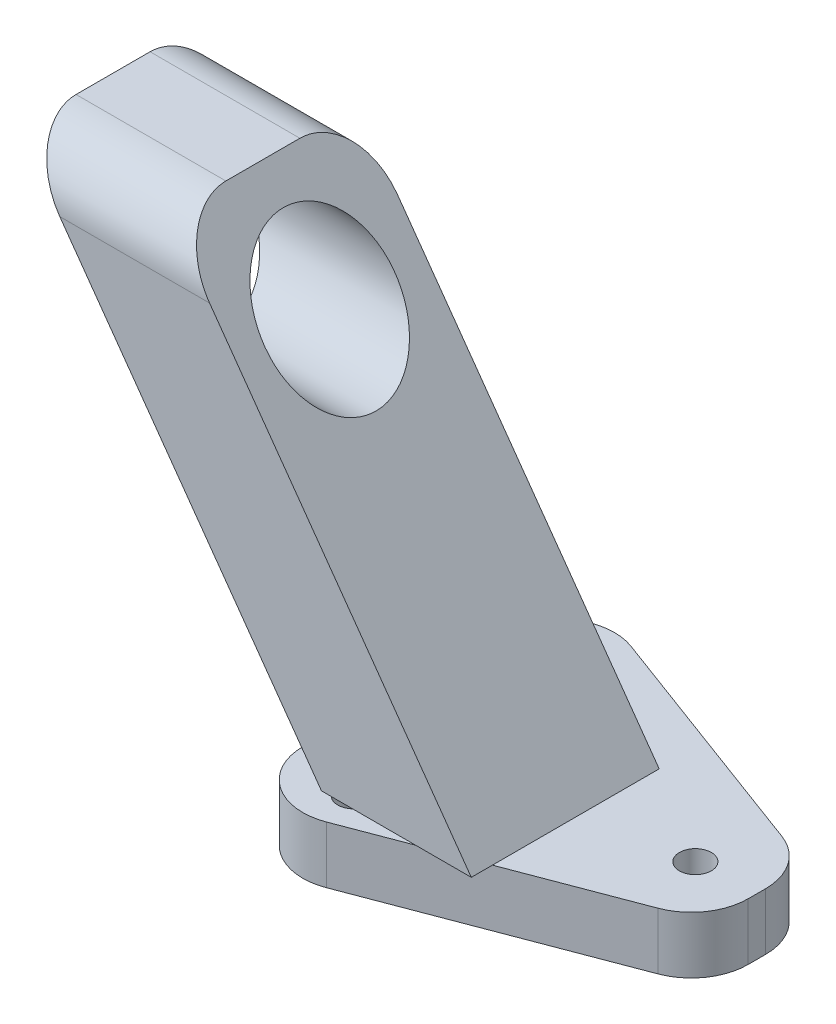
ISO-10303-21;
HEADER;
FILE_DESCRIPTION(('STEP AP214'),'2;1');
FILE_NAME('part.step','',(''),(''),'','','');
FILE_SCHEMA(('AUTOMOTIVE_DESIGN { 1 0 10303 214 1 1 1 1 }'));
ENDSEC;
DATA;
#1=APPLICATION_CONTEXT('core data for automotive mechanical design processes');
#2=APPLICATION_PROTOCOL_DEFINITION('international standard','automotive_design',2000,#1);
#3=PRODUCT_CONTEXT('',#1,'mechanical');
#4=PRODUCT('Part','Part','',(#3));
#5=PRODUCT_RELATED_PRODUCT_CATEGORY('part','',(#4));
#6=PRODUCT_DEFINITION_FORMATION('','',#4);
#7=PRODUCT_DEFINITION_CONTEXT('part definition',#1,'design');
#8=PRODUCT_DEFINITION('design','',#6,#7);
#9=PRODUCT_DEFINITION_SHAPE('','',#8);
#10=(LENGTH_UNIT() NAMED_UNIT(*) SI_UNIT(.MILLI.,.METRE.));
#11=(NAMED_UNIT(*) PLANE_ANGLE_UNIT() SI_UNIT($,.RADIAN.));
#12=(NAMED_UNIT(*) SI_UNIT($,.STERADIAN.) SOLID_ANGLE_UNIT());
#13=UNCERTAINTY_MEASURE_WITH_UNIT(LENGTH_MEASURE(1.E-05),#10,'distance_accuracy_value','');
#14=(GEOMETRIC_REPRESENTATION_CONTEXT(3) GLOBAL_UNCERTAINTY_ASSIGNED_CONTEXT((#13)) GLOBAL_UNIT_ASSIGNED_CONTEXT((#10,
#11,#12)) REPRESENTATION_CONTEXT('',''));
#15=CARTESIAN_POINT('',(0.,0.,0.));
#16=DIRECTION('',(0.,0.,1.));
#17=DIRECTION('',(1.,0.,0.));
#18=AXIS2_PLACEMENT_3D('',#15,#16,#17);
#19=CARTESIAN_POINT('',(-36.1014587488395,42.2803798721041,-16.5));
#20=DIRECTION('',(-0.813802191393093,-0.58114197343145,0.));
#21=DIRECTION('',(0.58114197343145,-0.813802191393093,0.));
#22=AXIS2_PLACEMENT_3D('',#19,#20,#21);
#23=PLANE('',#22);
#24=CARTESIAN_POINT('',(-30.0659973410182,33.828621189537,-8.15405274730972));
#25=DIRECTION('',(-0.813802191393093,-0.58114197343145,0.));
#26=DIRECTION('',(0.58114197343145,-0.813802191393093,0.));
#27=AXIS2_PLACEMENT_3D('',#24,#25,#26);
#28=ELLIPSE('',#27,7.00415906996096,5.7);
#29=CARTESIAN_POINT('',(-25.9955865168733,28.128621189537,-8.15405274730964));
#30=VERTEX_POINT('',#29);
#31=EDGE_CURVE('E176',#30,#30,#28,.T.);
#32=ORIENTED_EDGE('',*,*,#31,.F.);
#33=EDGE_LOOP('',(#32));
#34=FACE_BOUND('',#33,.T.);
#35=DIRECTION('',(0.58114197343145,-0.813802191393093,0.));
#36=VECTOR('',#35,1.);
#37=CARTESIAN_POINT('',(-36.1014587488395,42.2803798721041,0.));
#38=LINE('',#37,#36);
#39=CARTESIAN_POINT('',(-32.4595122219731,37.1803798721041,0.));
#40=VERTEX_POINT('',#39);
#41=CARTESIAN_POINT('',(-9.47927247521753,5.,0.));
#42=VERTEX_POINT('',#41);
#43=EDGE_CURVE('E171',#40,#42,#38,.T.);
#44=ORIENTED_EDGE('',*,*,#43,.F.);
#45=CARTESIAN_POINT('',(-32.4595122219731,37.1803798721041,-5.));
#46=DIRECTION('',(-0.813802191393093,-0.58114197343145,0.));
#47=DIRECTION('',(-0.58114197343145,0.813802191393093,0.));
#48=AXIS2_PLACEMENT_3D('',#45,#46,#47);
#49=ELLIPSE('',#48,6.14399918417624,5.);
#50=CARTESIAN_POINT('',(-36.0300480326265,42.1803798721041,-5.));
#51=VERTEX_POINT('',#50);
#52=EDGE_CURVE('E278',#40,#51,#49,.T.);
#53=ORIENTED_EDGE('',*,*,#52,.T.);
#54=DIRECTION('',(0.,0.,-1.));
#55=VECTOR('',#54,1.);
#56=CARTESIAN_POINT('',(-36.0300480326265,42.1803798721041,-16.5));
#57=LINE('',#56,#55);
#58=CARTESIAN_POINT('',(-36.0300480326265,42.1803798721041,-11.5));
#59=VERTEX_POINT('',#58);
#60=EDGE_CURVE('E272',#51,#59,#57,.T.);
#61=ORIENTED_EDGE('',*,*,#60,.T.);
#62=CARTESIAN_POINT('',(-32.4595122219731,37.1803798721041,-11.5));
#63=DIRECTION('',(-0.813802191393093,-0.58114197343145,0.));
#64=DIRECTION('',(0.58114197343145,-0.813802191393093,0.));
#65=AXIS2_PLACEMENT_3D('',#62,#63,#64);
#66=ELLIPSE('',#65,6.14399918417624,5.);
#67=CARTESIAN_POINT('',(-32.4595122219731,37.1803798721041,-16.5));
#68=VERTEX_POINT('',#67);
#69=EDGE_CURVE('E276',#59,#68,#66,.T.);
#70=ORIENTED_EDGE('',*,*,#69,.T.);
#71=DIRECTION('',(0.58114197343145,-0.813802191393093,0.));
#72=VECTOR('',#71,1.);
#73=CARTESIAN_POINT('',(-36.1014587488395,42.2803798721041,-16.5));
#74=LINE('',#73,#72);
#75=CARTESIAN_POINT('',(-9.47927247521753,5.,-16.5));
#76=VERTEX_POINT('',#75);
#77=EDGE_CURVE('E165',#68,#76,#74,.T.);
#78=ORIENTED_EDGE('',*,*,#77,.T.);
#79=DIRECTION('',(0.,0.,1.));
#80=VECTOR('',#79,1.);
#81=CARTESIAN_POINT('',(-9.47927247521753,5.,-16.5));
#82=LINE('',#81,#80);
#83=EDGE_CURVE('E159',#76,#42,#82,.T.);
#84=ORIENTED_EDGE('',*,*,#83,.T.);
#85=EDGE_LOOP('',(#44,#53,#61,#70,#78,#84));
#86=FACE_BOUND('',#85,.T.);
#87=ADVANCED_FACE('F35',(#34,#86),#23,.T.);
#88=CARTESIAN_POINT('',(3.67525054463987,5.,-16.5));
#89=DIRECTION('',(0.813802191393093,0.58114197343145,0.));
#90=DIRECTION('',(-0.58114197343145,0.813802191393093,0.));
#91=AXIS2_PLACEMENT_3D('',#88,#89,#90);
#92=PLANE('',#91);
#93=CARTESIAN_POINT('',(-16.9114743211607,33.8286211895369,-8.15405274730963));
#94=DIRECTION('',(0.813802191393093,0.58114197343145,0.));
#95=DIRECTION('',(0.58114197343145,-0.813802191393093,0.));
#96=AXIS2_PLACEMENT_3D('',#93,#94,#95);
#97=ELLIPSE('',#96,7.00415906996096,5.7);
#98=CARTESIAN_POINT('',(-12.8410634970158,28.1286211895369,-8.15405274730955));
#99=VERTEX_POINT('',#98);
#100=EDGE_CURVE('E269',#99,#99,#97,.T.);
#101=ORIENTED_EDGE('',*,*,#100,.F.);
#102=EDGE_LOOP('',(#101));
#103=FACE_BOUND('',#102,.T.);
#104=DIRECTION('',(0.,0.,1.));
#105=VECTOR('',#104,1.);
#106=CARTESIAN_POINT('',(-22.8755250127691,42.1803798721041,-16.5));
#107=LINE('',#106,#105);
#108=CARTESIAN_POINT('',(-22.8755250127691,42.1803798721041,-11.5));
#109=VERTEX_POINT('',#108);
#110=CARTESIAN_POINT('',(-22.8755250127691,42.1803798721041,-5.));
#111=VERTEX_POINT('',#110);
#112=EDGE_CURVE('E286',#109,#111,#107,.T.);
#113=ORIENTED_EDGE('',*,*,#112,.T.);
#114=CARTESIAN_POINT('',(-19.3049892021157,37.1803798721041,-5.));
#115=DIRECTION('',(0.813802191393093,0.58114197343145,0.));
#116=DIRECTION('',(-0.58114197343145,0.813802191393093,0.));
#117=AXIS2_PLACEMENT_3D('',#114,#115,#116);
#118=ELLIPSE('',#117,6.14399918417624,5.);
#119=CARTESIAN_POINT('',(-19.3049892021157,37.1803798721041,0.));
#120=VERTEX_POINT('',#119);
#121=EDGE_CURVE('E43',#111,#120,#118,.T.);
#122=ORIENTED_EDGE('',*,*,#121,.T.);
#123=DIRECTION('',(-0.58114197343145,0.813802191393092,0.));
#124=VECTOR('',#123,1.);
#125=CARTESIAN_POINT('',(3.67525054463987,5.,0.));
#126=LINE('',#125,#124);
#127=CARTESIAN_POINT('',(3.67525054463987,5.,0.));
#128=VERTEX_POINT('',#127);
#129=EDGE_CURVE('E173',#128,#120,#126,.T.);
#130=ORIENTED_EDGE('',*,*,#129,.F.);
#131=DIRECTION('',(0.,0.,1.));
#132=VECTOR('',#131,1.);
#133=CARTESIAN_POINT('',(3.67525054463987,5.,-16.5));
#134=LINE('',#133,#132);
#135=CARTESIAN_POINT('',(3.67525054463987,5.,-1.85697986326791));
#136=VERTEX_POINT('',#135);
#137=EDGE_CURVE('E154',#136,#128,#134,.T.);
#138=ORIENTED_EDGE('',*,*,#137,.F.);
#139=CARTESIAN_POINT('',(3.67525054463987,5.,-16.5));
#140=VERTEX_POINT('',#139);
#141=EDGE_CURVE('E149',#140,#136,#134,.T.);
#142=ORIENTED_EDGE('',*,*,#141,.F.);
#143=DIRECTION('',(-0.58114197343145,0.813802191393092,0.));
#144=VECTOR('',#143,1.);
#145=CARTESIAN_POINT('',(3.67525054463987,5.,-16.5));
#146=LINE('',#145,#144);
#147=CARTESIAN_POINT('',(-19.3049892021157,37.1803798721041,-16.5));
#148=VERTEX_POINT('',#147);
#149=EDGE_CURVE('E151',#140,#148,#146,.T.);
#150=ORIENTED_EDGE('',*,*,#149,.T.);
#151=CARTESIAN_POINT('',(-19.3049892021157,37.1803798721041,-11.5));
#152=DIRECTION('',(0.813802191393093,0.58114197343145,0.));
#153=DIRECTION('',(0.58114197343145,-0.813802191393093,0.));
#154=AXIS2_PLACEMENT_3D('',#151,#152,#153);
#155=ELLIPSE('',#154,6.14399918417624,5.);
#156=EDGE_CURVE('E284',#148,#109,#155,.T.);
#157=ORIENTED_EDGE('',*,*,#156,.T.);
#158=EDGE_LOOP('',(#113,#122,#130,#138,#142,#150,#157));
#159=FACE_BOUND('',#158,.T.);
#160=ADVANCED_FACE('F150',(#103,#159),#92,.T.);
#161=CARTESIAN_POINT('',(0.,0.,-16.5));
#162=DIRECTION('',(0.,0.,1.));
#163=DIRECTION('',(1.,0.,0.));
#164=AXIS2_PLACEMENT_3D('',#161,#162,#163);
#165=PLANE('',#164);
#166=ORIENTED_EDGE('',*,*,#77,.F.);
#167=DIRECTION('',(-1.,0.,0.));
#168=VECTOR('',#167,1.);
#169=CARTESIAN_POINT('',(-22.8755250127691,37.1803798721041,-16.5));
#170=LINE('',#169,#168);
#171=EDGE_CURVE('E11',#68,#148,#170,.F.);
#172=ORIENTED_EDGE('',*,*,#171,.T.);
#173=ORIENTED_EDGE('',*,*,#149,.F.);
#174=DIRECTION('',(1.,0.,0.));
#175=VECTOR('',#174,1.);
#176=CARTESIAN_POINT('',(-9.47927247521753,5.,-16.5));
#177=LINE('',#176,#175);
#178=EDGE_CURVE('E163',#76,#140,#177,.T.);
#179=ORIENTED_EDGE('',*,*,#178,.F.);
#180=EDGE_LOOP('',(#166,#172,#173,#179));
#181=FACE_BOUND('',#180,.T.);
#182=ADVANCED_FACE('F162',(#181),#165,.F.);
#183=CARTESIAN_POINT('',(0.,0.,0.));
#184=DIRECTION('',(0.,0.,1.));
#185=DIRECTION('',(1.,0.,0.));
#186=AXIS2_PLACEMENT_3D('',#183,#184,#185);
#187=PLANE('',#186);
#188=ORIENTED_EDGE('',*,*,#129,.T.);
#189=DIRECTION('',(-1.,0.,0.));
#190=VECTOR('',#189,1.);
#191=CARTESIAN_POINT('',(0.,37.1803798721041,0.));
#192=LINE('',#191,#190);
#193=EDGE_CURVE('E273',#120,#40,#192,.T.);
#194=ORIENTED_EDGE('',*,*,#193,.T.);
#195=ORIENTED_EDGE('',*,*,#43,.T.);
#196=DIRECTION('',(1.,0.,0.));
#197=VECTOR('',#196,1.);
#198=CARTESIAN_POINT('',(-9.47927247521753,5.,0.));
#199=LINE('',#198,#197);
#200=CARTESIAN_POINT('',(-8.62127627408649,5.,0.));
#201=VERTEX_POINT('',#200);
#202=EDGE_CURVE('E180',#42,#201,#199,.T.);
#203=ORIENTED_EDGE('',*,*,#202,.T.);
#204=CARTESIAN_POINT('',(-6.73877486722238,5.,0.));
#205=VERTEX_POINT('',#204);
#206=EDGE_CURVE('E183',#201,#205,#199,.T.);
#207=ORIENTED_EDGE('',*,*,#206,.T.);
#208=CARTESIAN_POINT('',(-1.22352775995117,5.,0.));
#209=VERTEX_POINT('',#208);
#210=EDGE_CURVE('E185',#205,#209,#199,.T.);
#211=ORIENTED_EDGE('',*,*,#210,.T.);
#212=EDGE_CURVE('E184',#209,#128,#199,.T.);
#213=ORIENTED_EDGE('',*,*,#212,.T.);
#214=EDGE_LOOP('',(#188,#194,#195,#203,#207,#211,#213));
#215=FACE_BOUND('',#214,.T.);
#216=ADVANCED_FACE('F291',(#215),#187,.T.);
#217=CARTESIAN_POINT('',(-8.65360479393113,5.,-19.9071821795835));
#218=DIRECTION('',(0.,-1.,0.));
#219=DIRECTION('',(0.,0.,-1.));
#220=AXIS2_PLACEMENT_3D('',#217,#218,#219);
#221=PLANE('',#220);
#222=CARTESIAN_POINT('',(12.3199744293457,5.,-11.0314739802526));
#223=DIRECTION('',(0.,1.,0.));
#224=DIRECTION('',(0.,0.,1.));
#225=AXIS2_PLACEMENT_3D('',#222,#223,#224);
#226=CIRCLE('',#225,1.40125130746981);
#227=CARTESIAN_POINT('',(12.3199744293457,5.,-9.63022267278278));
#228=VERTEX_POINT('',#227);
#229=EDGE_CURVE('E190',#228,#228,#226,.T.);
#230=ORIENTED_EDGE('',*,*,#229,.F.);
#231=EDGE_LOOP('',(#230));
#232=FACE_BOUND('',#231,.T.);
#233=CARTESIAN_POINT('',(-7.68002557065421,5.,-21.0314739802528));
#234=DIRECTION('',(0.,1.,0.));
#235=DIRECTION('',(0.,0.,1.));
#236=AXIS2_PLACEMENT_3D('',#233,#234,#235);
#237=CIRCLE('',#236,1.39614747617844);
#238=CARTESIAN_POINT('',(-7.68002557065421,5.,-19.6353265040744));
#239=VERTEX_POINT('',#238);
#240=EDGE_CURVE('E203',#239,#239,#237,.T.);
#241=ORIENTED_EDGE('',*,*,#240,.F.);
#242=EDGE_LOOP('',(#241));
#243=FACE_BOUND('',#242,.T.);
#244=ORIENTED_EDGE('',*,*,#210,.F.);
#245=CARTESIAN_POINT('',(-7.68002557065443,5.,-1.0314739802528));
#246=DIRECTION('',(0.,1.,0.));
#247=DIRECTION('',(0.,0.,1.));
#248=AXIS2_PLACEMENT_3D('',#245,#246,#247);
#249=CIRCLE('',#248,1.39638513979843);
#250=EDGE_CURVE('E200',#201,#205,#249,.T.);
#251=ORIENTED_EDGE('',*,*,#250,.F.);
#252=ORIENTED_EDGE('',*,*,#202,.F.);
#253=ORIENTED_EDGE('',*,*,#83,.F.);
#254=ORIENTED_EDGE('',*,*,#178,.T.);
#255=ORIENTED_EDGE('',*,*,#141,.T.);
#256=DIRECTION('',(0.935072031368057,0.,-0.354457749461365));
#257=VECTOR('',#256,1.);
#258=CARTESIAN_POINT('',(14.231817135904,5.,-5.85865749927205));
#259=LINE('',#258,#257);
#260=CARTESIAN_POINT('',(14.231817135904,5.,-5.85865749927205));
#261=VERTEX_POINT('',#260);
#262=EDGE_CURVE('E217',#136,#261,#259,.T.);
#263=ORIENTED_EDGE('',*,*,#262,.T.);
#264=CARTESIAN_POINT('',(12.4595283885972,5.,-10.5340176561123));
#265=DIRECTION('',(0.,1.,0.));
#266=DIRECTION('',(0.,0.,-1.));
#267=AXIS2_PLACEMENT_3D('',#264,#265,#266);
#268=CIRCLE('',#267,5.);
#269=CARTESIAN_POINT('',(17.4595283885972,5.,-10.5340176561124));
#270=VERTEX_POINT('',#269);
#271=EDGE_CURVE('E221',#261,#270,#268,.T.);
#272=ORIENTED_EDGE('',*,*,#271,.T.);
#273=DIRECTION('',(0.,0.,-1.));
#274=VECTOR('',#273,1.);
#275=CARTESIAN_POINT('',(17.4595283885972,5.,-12.0674547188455));
#276=LINE('',#275,#274);
#277=CARTESIAN_POINT('',(17.4595283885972,5.,-12.0674547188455));
#278=VERTEX_POINT('',#277);
#279=EDGE_CURVE('E224',#270,#278,#276,.T.);
#280=ORIENTED_EDGE('',*,*,#279,.T.);
#281=CARTESIAN_POINT('',(12.4595283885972,5.,-12.0674547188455));
#282=DIRECTION('',(0.,1.,0.));
#283=DIRECTION('',(0.,0.,-1.));
#284=AXIS2_PLACEMENT_3D('',#281,#282,#283);
#285=CIRCLE('',#284,5.);
#286=CARTESIAN_POINT('',(14.2000135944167,5.,-16.7547472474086));
#287=VERTEX_POINT('',#286);
#288=EDGE_CURVE('E226',#278,#287,#285,.T.);
#289=ORIENTED_EDGE('',*,*,#288,.T.);
#290=DIRECTION('',(-0.937458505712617,0.,-0.348097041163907));
#291=VECTOR('',#290,1.);
#292=CARTESIAN_POINT('',(-6.91311958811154,5.,-24.5944747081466));
#293=LINE('',#292,#291);
#294=CARTESIAN_POINT('',(-6.91311958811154,5.,-24.5944747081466));
#295=VERTEX_POINT('',#294);
#296=EDGE_CURVE('E228',#287,#295,#293,.T.);
#297=ORIENTED_EDGE('',*,*,#296,.T.);
#298=CARTESIAN_POINT('',(-8.65360479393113,5.,-19.9071821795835));
#299=DIRECTION('',(0.,1.,0.));
#300=DIRECTION('',(0.,0.,-1.));
#301=AXIS2_PLACEMENT_3D('',#298,#299,#300);
#302=CIRCLE('',#301,5.);
#303=CARTESIAN_POINT('',(-13.6536047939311,5.,-19.9071821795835));
#304=VERTEX_POINT('',#303);
#305=EDGE_CURVE('E209',#295,#304,#302,.T.);
#306=ORIENTED_EDGE('',*,*,#305,.T.);
#307=DIRECTION('',(0.,0.,1.));
#308=VECTOR('',#307,1.);
#309=CARTESIAN_POINT('',(-13.6536047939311,5.,-19.9071821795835));
#310=LINE('',#309,#308);
#311=CARTESIAN_POINT('',(-13.6536047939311,5.,-2.53066238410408));
#312=VERTEX_POINT('',#311);
#313=EDGE_CURVE('E212',#304,#312,#310,.T.);
#314=ORIENTED_EDGE('',*,*,#313,.T.);
#315=CARTESIAN_POINT('',(-8.65360479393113,5.,-2.53066238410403));
#316=DIRECTION('',(0.,1.,0.));
#317=DIRECTION('',(0.,0.,-1.));
#318=AXIS2_PLACEMENT_3D('',#315,#316,#317);
#319=CIRCLE('',#318,5.);
#320=CARTESIAN_POINT('',(-6.88131604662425,5.,2.14469777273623));
#321=VERTEX_POINT('',#320);
#322=EDGE_CURVE('E215',#312,#321,#319,.T.);
#323=ORIENTED_EDGE('',*,*,#322,.T.);
#324=EDGE_CURVE('E218',#321,#209,#259,.T.);
#325=ORIENTED_EDGE('',*,*,#324,.T.);
#326=EDGE_LOOP('',(#244,#251,#252,#253,#254,#255,#263,#272,#280,#289,#297,#306,#314,#323,#325));
#327=FACE_BOUND('',#326,.T.);
#328=ADVANCED_FACE('F168',(#232,#243,#327),#221,.F.);
#329=CARTESIAN_POINT('',(-8.65360479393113,0.,-19.9071821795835));
#330=DIRECTION('',(0.,-1.,0.));
#331=DIRECTION('',(0.,0.,-1.));
#332=AXIS2_PLACEMENT_3D('',#329,#330,#331);
#333=PLANE('',#332);
#334=CARTESIAN_POINT('',(-7.68002557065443,0.,-1.0314739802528));
#335=DIRECTION('',(0.,1.,0.));
#336=DIRECTION('',(0.,0.,1.));
#337=AXIS2_PLACEMENT_3D('',#334,#335,#336);
#338=CIRCLE('',#337,1.39638513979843);
#339=CARTESIAN_POINT('',(-7.68002557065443,0.,0.364911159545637));
#340=VERTEX_POINT('',#339);
#341=EDGE_CURVE('E193',#340,#340,#338,.T.);
#342=ORIENTED_EDGE('',*,*,#341,.T.);
#343=EDGE_LOOP('',(#342));
#344=FACE_BOUND('',#343,.T.);
#345=CARTESIAN_POINT('',(-8.65360479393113,0.,-19.9071821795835));
#346=DIRECTION('',(0.,1.,0.));
#347=DIRECTION('',(0.,0.,-1.));
#348=AXIS2_PLACEMENT_3D('',#345,#346,#347);
#349=CIRCLE('',#348,5.);
#350=CARTESIAN_POINT('',(-6.91311958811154,0.,-24.5944747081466));
#351=VERTEX_POINT('',#350);
#352=CARTESIAN_POINT('',(-13.6536047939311,0.,-19.9071821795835));
#353=VERTEX_POINT('',#352);
#354=EDGE_CURVE('E206',#351,#353,#349,.T.);
#355=ORIENTED_EDGE('',*,*,#354,.F.);
#356=DIRECTION('',(-0.937458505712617,0.,-0.348097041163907));
#357=VECTOR('',#356,1.);
#358=CARTESIAN_POINT('',(-6.91311958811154,0.,-24.5944747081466));
#359=LINE('',#358,#357);
#360=CARTESIAN_POINT('',(14.2000135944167,0.,-16.7547472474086));
#361=VERTEX_POINT('',#360);
#362=EDGE_CURVE('E213',#361,#351,#359,.T.);
#363=ORIENTED_EDGE('',*,*,#362,.F.);
#364=CARTESIAN_POINT('',(12.4595283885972,0.,-12.0674547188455));
#365=DIRECTION('',(0.,1.,0.));
#366=DIRECTION('',(0.,0.,-1.));
#367=AXIS2_PLACEMENT_3D('',#364,#365,#366);
#368=CIRCLE('',#367,5.);
#369=CARTESIAN_POINT('',(17.4595283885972,0.,-12.0674547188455));
#370=VERTEX_POINT('',#369);
#371=EDGE_CURVE('E243',#370,#361,#368,.T.);
#372=ORIENTED_EDGE('',*,*,#371,.F.);
#373=DIRECTION('',(0.,0.,-1.));
#374=VECTOR('',#373,1.);
#375=CARTESIAN_POINT('',(17.4595283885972,0.,-12.0674547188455));
#376=LINE('',#375,#374);
#377=CARTESIAN_POINT('',(17.4595283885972,0.,-10.5340176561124));
#378=VERTEX_POINT('',#377);
#379=EDGE_CURVE('E241',#378,#370,#376,.T.);
#380=ORIENTED_EDGE('',*,*,#379,.F.);
#381=CARTESIAN_POINT('',(12.4595283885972,0.,-10.5340176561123));
#382=DIRECTION('',(0.,1.,0.));
#383=DIRECTION('',(0.,0.,-1.));
#384=AXIS2_PLACEMENT_3D('',#381,#382,#383);
#385=CIRCLE('',#384,5.);
#386=CARTESIAN_POINT('',(14.231817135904,0.,-5.85865749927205));
#387=VERTEX_POINT('',#386);
#388=EDGE_CURVE('E239',#387,#378,#385,.T.);
#389=ORIENTED_EDGE('',*,*,#388,.F.);
#390=DIRECTION('',(0.935072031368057,0.,-0.354457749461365));
#391=VECTOR('',#390,1.);
#392=CARTESIAN_POINT('',(14.231817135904,0.,-5.85865749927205));
#393=LINE('',#392,#391);
#394=CARTESIAN_POINT('',(-6.88131604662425,0.,2.14469777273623));
#395=VERTEX_POINT('',#394);
#396=EDGE_CURVE('E237',#395,#387,#393,.T.);
#397=ORIENTED_EDGE('',*,*,#396,.F.);
#398=CARTESIAN_POINT('',(-8.65360479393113,0.,-2.53066238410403));
#399=DIRECTION('',(0.,1.,0.));
#400=DIRECTION('',(0.,0.,-1.));
#401=AXIS2_PLACEMENT_3D('',#398,#399,#400);
#402=CIRCLE('',#401,5.);
#403=CARTESIAN_POINT('',(-13.6536047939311,0.,-2.53066238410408));
#404=VERTEX_POINT('',#403);
#405=EDGE_CURVE('E235',#404,#395,#402,.T.);
#406=ORIENTED_EDGE('',*,*,#405,.F.);
#407=DIRECTION('',(0.,0.,1.));
#408=VECTOR('',#407,1.);
#409=CARTESIAN_POINT('',(-13.6536047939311,0.,-19.9071821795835));
#410=LINE('',#409,#408);
#411=EDGE_CURVE('E233',#353,#404,#410,.T.);
#412=ORIENTED_EDGE('',*,*,#411,.F.);
#413=EDGE_LOOP('',(#355,#363,#372,#380,#389,#397,#406,#412));
#414=FACE_BOUND('',#413,.T.);
#415=CARTESIAN_POINT('',(-7.68002557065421,0.,-21.0314739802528));
#416=DIRECTION('',(0.,1.,0.));
#417=DIRECTION('',(0.,0.,1.));
#418=AXIS2_PLACEMENT_3D('',#415,#416,#417);
#419=CIRCLE('',#418,1.39614747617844);
#420=CARTESIAN_POINT('',(-7.68002557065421,0.,-19.6353265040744));
#421=VERTEX_POINT('',#420);
#422=EDGE_CURVE('E199',#421,#421,#419,.T.);
#423=ORIENTED_EDGE('',*,*,#422,.T.);
#424=EDGE_LOOP('',(#423));
#425=FACE_BOUND('',#424,.T.);
#426=CARTESIAN_POINT('',(12.3199744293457,0.,-11.0314739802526));
#427=DIRECTION('',(0.,1.,0.));
#428=DIRECTION('',(0.,0.,1.));
#429=AXIS2_PLACEMENT_3D('',#426,#427,#428);
#430=CIRCLE('',#429,1.40125130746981);
#431=CARTESIAN_POINT('',(12.3199744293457,0.,-9.63022267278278));
#432=VERTEX_POINT('',#431);
#433=EDGE_CURVE('E188',#432,#432,#430,.T.);
#434=ORIENTED_EDGE('',*,*,#433,.T.);
#435=EDGE_LOOP('',(#434));
#436=FACE_BOUND('',#435,.T.);
#437=ADVANCED_FACE('F352',(#344,#414,#425,#436),#333,.T.);
#438=CARTESIAN_POINT('',(-8.65360479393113,5.,-19.9071821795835));
#439=DIRECTION('',(0.,-1.,0.));
#440=DIRECTION('',(0.,0.,-1.));
#441=AXIS2_PLACEMENT_3D('',#438,#439,#440);
#442=CYLINDRICAL_SURFACE('',#441,5.);
#443=ORIENTED_EDGE('',*,*,#354,.T.);
#444=DIRECTION('',(0.,-1.,0.));
#445=VECTOR('',#444,1.);
#446=CARTESIAN_POINT('',(-13.6536047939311,5.,-19.9071821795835));
#447=LINE('',#446,#445);
#448=EDGE_CURVE('E266',#304,#353,#447,.T.);
#449=ORIENTED_EDGE('',*,*,#448,.F.);
#450=ORIENTED_EDGE('',*,*,#305,.F.);
#451=DIRECTION('',(0.,-1.,0.));
#452=VECTOR('',#451,1.);
#453=CARTESIAN_POINT('',(-6.91311958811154,5.,-24.5944747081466));
#454=LINE('',#453,#452);
#455=EDGE_CURVE('E230',#295,#351,#454,.T.);
#456=ORIENTED_EDGE('',*,*,#455,.T.);
#457=EDGE_LOOP('',(#443,#449,#450,#456));
#458=FACE_BOUND('',#457,.T.);
#459=ADVANCED_FACE('F348',(#458),#442,.T.);
#460=CARTESIAN_POINT('',(-13.6536047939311,5.,-19.9071821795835));
#461=DIRECTION('',(1.,0.,0.));
#462=DIRECTION('',(0.,0.,-1.));
#463=AXIS2_PLACEMENT_3D('',#460,#461,#462);
#464=PLANE('',#463);
#465=ORIENTED_EDGE('',*,*,#411,.T.);
#466=DIRECTION('',(0.,-1.,0.));
#467=VECTOR('',#466,1.);
#468=CARTESIAN_POINT('',(-13.6536047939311,5.,-2.53066238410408));
#469=LINE('',#468,#467);
#470=EDGE_CURVE('E263',#312,#404,#469,.T.);
#471=ORIENTED_EDGE('',*,*,#470,.F.);
#472=ORIENTED_EDGE('',*,*,#313,.F.);
#473=ORIENTED_EDGE('',*,*,#448,.T.);
#474=EDGE_LOOP('',(#465,#471,#472,#473));
#475=FACE_BOUND('',#474,.T.);
#476=ADVANCED_FACE('F351',(#475),#464,.F.);
#477=CARTESIAN_POINT('',(-8.65360479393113,5.,-2.53066238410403));
#478=DIRECTION('',(0.,-1.,0.));
#479=DIRECTION('',(0.,0.,-1.));
#480=AXIS2_PLACEMENT_3D('',#477,#478,#479);
#481=CYLINDRICAL_SURFACE('',#480,5.);
#482=ORIENTED_EDGE('',*,*,#405,.T.);
#483=DIRECTION('',(0.,-1.,0.));
#484=VECTOR('',#483,1.);
#485=CARTESIAN_POINT('',(-6.88131604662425,5.,2.14469777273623));
#486=LINE('',#485,#484);
#487=EDGE_CURVE('E260',#321,#395,#486,.T.);
#488=ORIENTED_EDGE('',*,*,#487,.F.);
#489=ORIENTED_EDGE('',*,*,#322,.F.);
#490=ORIENTED_EDGE('',*,*,#470,.T.);
#491=EDGE_LOOP('',(#482,#488,#489,#490));
#492=FACE_BOUND('',#491,.T.);
#493=ADVANCED_FACE('F356',(#492),#481,.T.);
#494=CARTESIAN_POINT('',(14.231817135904,5.,-5.85865749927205));
#495=DIRECTION('',(-0.354457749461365,0.,-0.935072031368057));
#496=DIRECTION('',(-0.935072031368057,0.,0.354457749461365));
#497=AXIS2_PLACEMENT_3D('',#494,#495,#496);
#498=PLANE('',#497);
#499=ORIENTED_EDGE('',*,*,#396,.T.);
#500=DIRECTION('',(0.,-1.,0.));
#501=VECTOR('',#500,1.);
#502=CARTESIAN_POINT('',(14.231817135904,5.,-5.85865749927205));
#503=LINE('',#502,#501);
#504=EDGE_CURVE('E257',#261,#387,#503,.T.);
#505=ORIENTED_EDGE('',*,*,#504,.F.);
#506=ORIENTED_EDGE('',*,*,#262,.F.);
#507=EDGE_CURVE('E222',#209,#136,#259,.T.);
#508=ORIENTED_EDGE('',*,*,#507,.F.);
#509=ORIENTED_EDGE('',*,*,#324,.F.);
#510=ORIENTED_EDGE('',*,*,#487,.T.);
#511=EDGE_LOOP('',(#499,#505,#506,#508,#509,#510));
#512=FACE_BOUND('',#511,.T.);
#513=ADVANCED_FACE('F360',(#512),#498,.F.);
#514=CARTESIAN_POINT('',(12.4595283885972,5.,-10.5340176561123));
#515=DIRECTION('',(0.,-1.,0.));
#516=DIRECTION('',(0.,0.,-1.));
#517=AXIS2_PLACEMENT_3D('',#514,#515,#516);
#518=CYLINDRICAL_SURFACE('',#517,5.);
#519=ORIENTED_EDGE('',*,*,#388,.T.);
#520=DIRECTION('',(0.,-1.,0.));
#521=VECTOR('',#520,1.);
#522=CARTESIAN_POINT('',(17.4595283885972,5.,-10.5340176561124));
#523=LINE('',#522,#521);
#524=EDGE_CURVE('E254',#270,#378,#523,.T.);
#525=ORIENTED_EDGE('',*,*,#524,.F.);
#526=ORIENTED_EDGE('',*,*,#271,.F.);
#527=ORIENTED_EDGE('',*,*,#504,.T.);
#528=EDGE_LOOP('',(#519,#525,#526,#527));
#529=FACE_BOUND('',#528,.T.);
#530=ADVANCED_FACE('F364',(#529),#518,.T.);
#531=CARTESIAN_POINT('',(17.4595283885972,5.,-12.0674547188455));
#532=DIRECTION('',(-1.,0.,0.));
#533=DIRECTION('',(0.,0.,1.));
#534=AXIS2_PLACEMENT_3D('',#531,#532,#533);
#535=PLANE('',#534);
#536=ORIENTED_EDGE('',*,*,#379,.T.);
#537=DIRECTION('',(0.,-1.,0.));
#538=VECTOR('',#537,1.);
#539=CARTESIAN_POINT('',(17.4595283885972,5.,-12.0674547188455));
#540=LINE('',#539,#538);
#541=EDGE_CURVE('E251',#278,#370,#540,.T.);
#542=ORIENTED_EDGE('',*,*,#541,.F.);
#543=ORIENTED_EDGE('',*,*,#279,.F.);
#544=ORIENTED_EDGE('',*,*,#524,.T.);
#545=EDGE_LOOP('',(#536,#542,#543,#544));
#546=FACE_BOUND('',#545,.T.);
#547=ADVANCED_FACE('F368',(#546),#535,.F.);
#548=CARTESIAN_POINT('',(12.4595283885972,5.,-12.0674547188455));
#549=DIRECTION('',(0.,-1.,0.));
#550=DIRECTION('',(0.,0.,-1.));
#551=AXIS2_PLACEMENT_3D('',#548,#549,#550);
#552=CYLINDRICAL_SURFACE('',#551,5.);
#553=ORIENTED_EDGE('',*,*,#371,.T.);
#554=DIRECTION('',(0.,-1.,0.));
#555=VECTOR('',#554,1.);
#556=CARTESIAN_POINT('',(14.2000135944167,5.,-16.7547472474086));
#557=LINE('',#556,#555);
#558=EDGE_CURVE('E248',#287,#361,#557,.T.);
#559=ORIENTED_EDGE('',*,*,#558,.F.);
#560=ORIENTED_EDGE('',*,*,#288,.F.);
#561=ORIENTED_EDGE('',*,*,#541,.T.);
#562=EDGE_LOOP('',(#553,#559,#560,#561));
#563=FACE_BOUND('',#562,.T.);
#564=ADVANCED_FACE('F372',(#563),#552,.T.);
#565=CARTESIAN_POINT('',(-6.91311958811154,5.,-24.5944747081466));
#566=DIRECTION('',(-0.348097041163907,0.,0.937458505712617));
#567=DIRECTION('',(0.937458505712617,0.,0.348097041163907));
#568=AXIS2_PLACEMENT_3D('',#565,#566,#567);
#569=PLANE('',#568);
#570=ORIENTED_EDGE('',*,*,#362,.T.);
#571=ORIENTED_EDGE('',*,*,#455,.F.);
#572=ORIENTED_EDGE('',*,*,#296,.F.);
#573=ORIENTED_EDGE('',*,*,#558,.T.);
#574=EDGE_LOOP('',(#570,#571,#572,#573));
#575=FACE_BOUND('',#574,.T.);
#576=ADVANCED_FACE('F376',(#575),#569,.F.);
#577=CARTESIAN_POINT('',(-7.68002557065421,5.,-21.0314739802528));
#578=DIRECTION('',(0.,-1.,0.));
#579=DIRECTION('',(0.,0.,-1.));
#580=AXIS2_PLACEMENT_3D('',#577,#578,#579);
#581=CYLINDRICAL_SURFACE('',#580,1.39614747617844);
#582=ORIENTED_EDGE('',*,*,#240,.T.);
#583=EDGE_LOOP('',(#582));
#584=FACE_BOUND('',#583,.T.);
#585=ORIENTED_EDGE('',*,*,#422,.F.);
#586=EDGE_LOOP('',(#585));
#587=FACE_BOUND('',#586,.T.);
#588=ADVANCED_FACE('F380',(#584,#587),#581,.F.);
#589=CARTESIAN_POINT('',(-7.68002557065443,5.,-1.0314739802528));
#590=DIRECTION('',(0.,-1.,0.));
#591=DIRECTION('',(0.,0.,-1.));
#592=AXIS2_PLACEMENT_3D('',#589,#590,#591);
#593=CYLINDRICAL_SURFACE('',#592,1.39638513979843);
#594=EDGE_CURVE('E196',#205,#201,#249,.T.);
#595=ORIENTED_EDGE('',*,*,#594,.T.);
#596=ORIENTED_EDGE('',*,*,#250,.T.);
#597=EDGE_LOOP('',(#595,#596));
#598=FACE_BOUND('',#597,.T.);
#599=ORIENTED_EDGE('',*,*,#341,.F.);
#600=EDGE_LOOP('',(#599));
#601=FACE_BOUND('',#600,.T.);
#602=ADVANCED_FACE('F308',(#598,#601),#593,.F.);
#603=CARTESIAN_POINT('',(12.3199744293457,5.,-11.0314739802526));
#604=DIRECTION('',(0.,-1.,0.));
#605=DIRECTION('',(0.,0.,-1.));
#606=AXIS2_PLACEMENT_3D('',#603,#604,#605);
#607=CYLINDRICAL_SURFACE('',#606,1.40125130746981);
#608=ORIENTED_EDGE('',*,*,#229,.T.);
#609=EDGE_LOOP('',(#608));
#610=FACE_BOUND('',#609,.T.);
#611=ORIENTED_EDGE('',*,*,#433,.F.);
#612=EDGE_LOOP('',(#611));
#613=FACE_BOUND('',#612,.T.);
#614=ADVANCED_FACE('F313',(#610,#613),#607,.F.);
#615=CARTESIAN_POINT('',(-9.47927247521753,5.,-16.5));
#616=DIRECTION('',(0.,-1.,0.));
#617=DIRECTION('',(0.,0.,-1.));
#618=AXIS2_PLACEMENT_3D('',#615,#616,#617);
#619=PLANE('',#618);
#620=ORIENTED_EDGE('',*,*,#594,.F.);
#621=ORIENTED_EDGE('',*,*,#206,.F.);
#622=EDGE_LOOP('',(#620,#621));
#623=FACE_BOUND('',#622,.T.);
#624=ADVANCED_FACE('F310',(#623),#619,.T.);
#625=ORIENTED_EDGE('',*,*,#212,.F.);
#626=ORIENTED_EDGE('',*,*,#507,.T.);
#627=ORIENTED_EDGE('',*,*,#137,.T.);
#628=EDGE_LOOP('',(#625,#626,#627));
#629=FACE_BOUND('',#628,.T.);
#630=ADVANCED_FACE('F312',(#629),#619,.T.);
#631=CARTESIAN_POINT('',(-48.6706395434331,33.8286211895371,-8.15405274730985));
#632=DIRECTION('',(1.,0.,0.));
#633=DIRECTION('',(0.,1.,0.));
#634=AXIS2_PLACEMENT_3D('',#631,#632,#633);
#635=CYLINDRICAL_SURFACE('',#634,5.7);
#636=ORIENTED_EDGE('',*,*,#31,.T.);
#637=EDGE_LOOP('',(#636));
#638=FACE_BOUND('',#637,.T.);
#639=ORIENTED_EDGE('',*,*,#100,.T.);
#640=EDGE_LOOP('',(#639));
#641=FACE_BOUND('',#640,.T.);
#642=ADVANCED_FACE('F319',(#638,#641),#635,.F.);
#643=CARTESIAN_POINT('',(0.,42.1803798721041,0.));
#644=DIRECTION('',(0.,1.,0.));
#645=DIRECTION('',(0.,0.,1.));
#646=AXIS2_PLACEMENT_3D('',#643,#644,#645);
#647=PLANE('',#646);
#648=ORIENTED_EDGE('',*,*,#60,.F.);
#649=DIRECTION('',(-1.,0.,0.));
#650=VECTOR('',#649,1.);
#651=CARTESIAN_POINT('',(0.,42.1803798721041,-5.));
#652=LINE('',#651,#650);
#653=EDGE_CURVE('E56',#51,#111,#652,.F.);
#654=ORIENTED_EDGE('',*,*,#653,.T.);
#655=ORIENTED_EDGE('',*,*,#112,.F.);
#656=DIRECTION('',(-1.,0.,0.));
#657=VECTOR('',#656,1.);
#658=CARTESIAN_POINT('',(-36.0300480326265,42.1803798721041,-11.5));
#659=LINE('',#658,#657);
#660=EDGE_CURVE('E280',#109,#59,#659,.T.);
#661=ORIENTED_EDGE('',*,*,#660,.T.);
#662=EDGE_LOOP('',(#648,#654,#655,#661));
#663=FACE_BOUND('',#662,.T.);
#664=ADVANCED_FACE('F297',(#663),#647,.T.);
#665=CARTESIAN_POINT('',(0.,37.1803798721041,-5.));
#666=DIRECTION('',(-1.,0.,0.));
#667=DIRECTION('',(0.,0.,1.));
#668=AXIS2_PLACEMENT_3D('',#665,#666,#667);
#669=CYLINDRICAL_SURFACE('',#668,5.);
#670=ORIENTED_EDGE('',*,*,#121,.F.);
#671=ORIENTED_EDGE('',*,*,#653,.F.);
#672=ORIENTED_EDGE('',*,*,#52,.F.);
#673=ORIENTED_EDGE('',*,*,#193,.F.);
#674=EDGE_LOOP('',(#670,#671,#672,#673));
#675=FACE_BOUND('',#674,.T.);
#676=ADVANCED_FACE('F294',(#675),#669,.T.);
#677=CARTESIAN_POINT('',(0.,37.1803798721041,-11.5));
#678=DIRECTION('',(1.,0.,0.));
#679=DIRECTION('',(0.,0.,-1.));
#680=AXIS2_PLACEMENT_3D('',#677,#678,#679);
#681=CYLINDRICAL_SURFACE('',#680,5.);
#682=ORIENTED_EDGE('',*,*,#156,.F.);
#683=ORIENTED_EDGE('',*,*,#171,.F.);
#684=ORIENTED_EDGE('',*,*,#69,.F.);
#685=ORIENTED_EDGE('',*,*,#660,.F.);
#686=EDGE_LOOP('',(#682,#683,#684,#685));
#687=FACE_BOUND('',#686,.T.);
#688=ADVANCED_FACE('F37',(#687),#681,.T.);
#689=CLOSED_SHELL('',(#87,#160,#182,#216,#328,#437,#459,#476,#493,#513,#530,#547,#564,#576,#588,
#602,#614,#624,#630,#642,#664,#676,#688));
#690=MANIFOLD_SOLID_BREP('B2',#689);
#691=ADVANCED_BREP_SHAPE_REPRESENTATION('',(#18,#690),#14);
#692=SHAPE_DEFINITION_REPRESENTATION(#9,#691);
ENDSEC;
END-ISO-10303-21;
